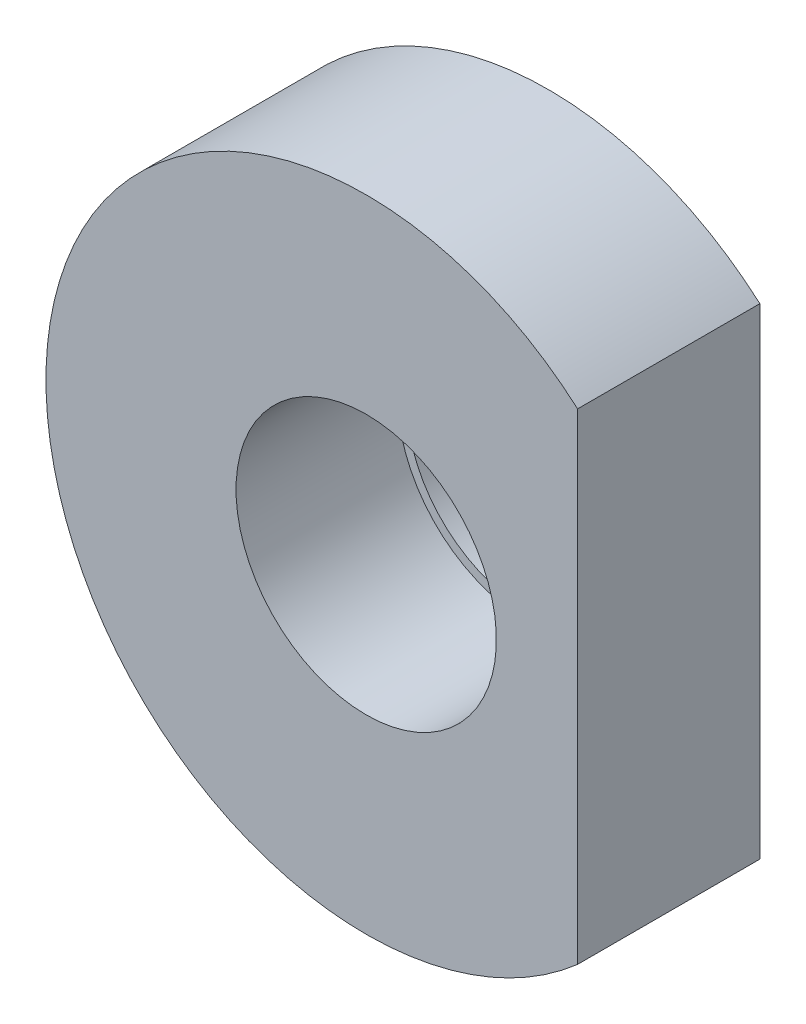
ISO-10303-21;
HEADER;
FILE_DESCRIPTION(('STEP AP214'),'2;1');
FILE_NAME('part.step','',(''),(''),'','','');
FILE_SCHEMA(('AUTOMOTIVE_DESIGN { 1 0 10303 214 1 1 1 1 }'));
ENDSEC;
DATA;
#1=APPLICATION_CONTEXT('core data for automotive mechanical design processes');
#2=APPLICATION_PROTOCOL_DEFINITION('international standard','automotive_design',2000,#1);
#3=PRODUCT_CONTEXT('',#1,'mechanical');
#4=PRODUCT('Part','Part','',(#3));
#5=PRODUCT_RELATED_PRODUCT_CATEGORY('part','',(#4));
#6=PRODUCT_DEFINITION_FORMATION('','',#4);
#7=PRODUCT_DEFINITION_CONTEXT('part definition',#1,'design');
#8=PRODUCT_DEFINITION('design','',#6,#7);
#9=PRODUCT_DEFINITION_SHAPE('','',#8);
#10=(LENGTH_UNIT() NAMED_UNIT(*) SI_UNIT(.MILLI.,.METRE.));
#11=(NAMED_UNIT(*) PLANE_ANGLE_UNIT() SI_UNIT($,.RADIAN.));
#12=(NAMED_UNIT(*) SI_UNIT($,.STERADIAN.) SOLID_ANGLE_UNIT());
#13=UNCERTAINTY_MEASURE_WITH_UNIT(LENGTH_MEASURE(1.E-05),#10,'distance_accuracy_value','');
#14=(GEOMETRIC_REPRESENTATION_CONTEXT(3) GLOBAL_UNCERTAINTY_ASSIGNED_CONTEXT((#13)) GLOBAL_UNIT_ASSIGNED_CONTEXT((#10,
#11,#12)) REPRESENTATION_CONTEXT('',''));
#15=CARTESIAN_POINT('',(0.,0.,0.));
#16=DIRECTION('',(0.,0.,1.));
#17=DIRECTION('',(1.,0.,0.));
#18=AXIS2_PLACEMENT_3D('',#15,#16,#17);
#19=CARTESIAN_POINT('',(0.,0.,8.89));
#20=DIRECTION('',(0.,0.,-1.));
#21=DIRECTION('',(0.,1.,0.));
#22=AXIS2_PLACEMENT_3D('',#19,#20,#21);
#23=CYLINDRICAL_SURFACE('',#22,15.621);
#24=DIRECTION('',(0.,0.,-1.));
#25=VECTOR('',#24,1.);
#26=CARTESIAN_POINT('',(10.3124,-11.7332879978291,67.4479521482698));
#27=LINE('',#26,#25);
#28=CARTESIAN_POINT('',(10.3124,-11.7332879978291,8.89));
#29=VERTEX_POINT('',#28);
#30=CARTESIAN_POINT('',(10.3124,-11.7332879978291,0.));
#31=VERTEX_POINT('',#30);
#32=EDGE_CURVE('E35',#29,#31,#27,.T.);
#33=ORIENTED_EDGE('',*,*,#32,.F.);
#34=CARTESIAN_POINT('',(0.,0.,8.89));
#35=DIRECTION('',(0.,0.,1.));
#36=DIRECTION('',(0.,-1.,0.));
#37=AXIS2_PLACEMENT_3D('',#34,#35,#36);
#38=CIRCLE('',#37,15.621);
#39=CARTESIAN_POINT('',(10.3124,11.7332879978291,8.89));
#40=VERTEX_POINT('',#39);
#41=EDGE_CURVE('E22',#40,#29,#38,.T.);
#42=ORIENTED_EDGE('',*,*,#41,.F.);
#43=DIRECTION('',(0.,0.,-1.));
#44=VECTOR('',#43,1.);
#45=CARTESIAN_POINT('',(10.3124,11.7332879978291,67.4479521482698));
#46=LINE('',#45,#44);
#47=CARTESIAN_POINT('',(10.3124,11.7332879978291,0.));
#48=VERTEX_POINT('',#47);
#49=EDGE_CURVE('E48',#40,#48,#46,.T.);
#50=ORIENTED_EDGE('',*,*,#49,.T.);
#51=CARTESIAN_POINT('',(0.,0.,0.));
#52=DIRECTION('',(0.,0.,1.));
#53=DIRECTION('',(0.,-1.,0.));
#54=AXIS2_PLACEMENT_3D('',#51,#52,#53);
#55=CIRCLE('',#54,15.621);
#56=EDGE_CURVE('E42',#48,#31,#55,.T.);
#57=ORIENTED_EDGE('',*,*,#56,.T.);
#58=EDGE_LOOP('',(#33,#42,#50,#57));
#59=FACE_BOUND('',#58,.T.);
#60=ADVANCED_FACE('F14',(#59),#23,.T.);
#61=CARTESIAN_POINT('',(0.,0.,8.89));
#62=DIRECTION('',(0.,0.,1.));
#63=DIRECTION('',(0.,-1.,0.));
#64=AXIS2_PLACEMENT_3D('',#61,#62,#63);
#65=PLANE('',#64);
#66=CARTESIAN_POINT('',(0.,0.,8.89));
#67=DIRECTION('',(0.,0.,1.));
#68=DIRECTION('',(0.,-1.,0.));
#69=AXIS2_PLACEMENT_3D('',#66,#67,#68);
#70=CIRCLE('',#69,6.35);
#71=CARTESIAN_POINT('',(0.,-6.35,8.89));
#72=VERTEX_POINT('',#71);
#73=EDGE_CURVE('E17',#72,#72,#70,.T.);
#74=ORIENTED_EDGE('',*,*,#73,.F.);
#75=EDGE_LOOP('',(#74));
#76=FACE_BOUND('',#75,.T.);
#77=ORIENTED_EDGE('',*,*,#41,.T.);
#78=DIRECTION('',(0.,1.,0.));
#79=VECTOR('',#78,1.);
#80=CARTESIAN_POINT('',(10.3124,0.,8.89));
#81=LINE('',#80,#79);
#82=EDGE_CURVE('E28',#29,#40,#81,.T.);
#83=ORIENTED_EDGE('',*,*,#82,.T.);
#84=EDGE_LOOP('',(#77,#83));
#85=FACE_BOUND('',#84,.T.);
#86=ADVANCED_FACE('F58',(#76,#85),#65,.T.);
#87=CARTESIAN_POINT('',(0.,0.,0.));
#88=DIRECTION('',(0.,0.,1.));
#89=DIRECTION('',(0.,-1.,0.));
#90=AXIS2_PLACEMENT_3D('',#87,#88,#89);
#91=PLANE('',#90);
#92=DIRECTION('',(0.,1.,0.));
#93=VECTOR('',#92,1.);
#94=CARTESIAN_POINT('',(10.3124,0.,0.));
#95=LINE('',#94,#93);
#96=EDGE_CURVE('E9',#31,#48,#95,.T.);
#97=ORIENTED_EDGE('',*,*,#96,.F.);
#98=ORIENTED_EDGE('',*,*,#56,.F.);
#99=EDGE_LOOP('',(#97,#98));
#100=FACE_BOUND('',#99,.T.);
#101=CARTESIAN_POINT('',(0.,0.,0.));
#102=DIRECTION('',(0.,0.,1.));
#103=DIRECTION('',(1.,0.,0.));
#104=AXIS2_PLACEMENT_3D('',#101,#102,#103);
#105=CIRCLE('',#104,5.9);
#106=CARTESIAN_POINT('',(5.9,0.,0.));
#107=VERTEX_POINT('',#106);
#108=EDGE_CURVE('E89',#107,#107,#105,.F.);
#109=ORIENTED_EDGE('',*,*,#108,.F.);
#110=EDGE_LOOP('',(#109));
#111=FACE_BOUND('',#110,.T.);
#112=ADVANCED_FACE('F44',(#100,#111),#91,.F.);
#113=CARTESIAN_POINT('',(10.3124,11.7332879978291,67.4479521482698));
#114=DIRECTION('',(1.,0.,0.));
#115=DIRECTION('',(0.,0.,1.));
#116=AXIS2_PLACEMENT_3D('',#113,#114,#115);
#117=PLANE('',#116);
#118=ORIENTED_EDGE('',*,*,#82,.F.);
#119=ORIENTED_EDGE('',*,*,#32,.T.);
#120=ORIENTED_EDGE('',*,*,#96,.T.);
#121=ORIENTED_EDGE('',*,*,#49,.F.);
#122=EDGE_LOOP('',(#118,#119,#120,#121));
#123=FACE_BOUND('',#122,.T.);
#124=ADVANCED_FACE('F51',(#123),#117,.T.);
#125=CARTESIAN_POINT('',(0.,0.,13.2527327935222));
#126=DIRECTION('',(0.,0.,1.));
#127=DIRECTION('',(0.,-1.,0.));
#128=AXIS2_PLACEMENT_3D('',#125,#126,#127);
#129=CYLINDRICAL_SURFACE('',#128,6.35);
#130=ORIENTED_EDGE('',*,*,#73,.T.);
#131=EDGE_LOOP('',(#130));
#132=FACE_BOUND('',#131,.T.);
#133=CARTESIAN_POINT('',(0.,0.,1.016));
#134=DIRECTION('',(0.,0.,1.));
#135=DIRECTION('',(0.,-1.,0.));
#136=AXIS2_PLACEMENT_3D('',#133,#134,#135);
#137=CIRCLE('',#136,6.35);
#138=CARTESIAN_POINT('',(0.,-6.35,1.016));
#139=VERTEX_POINT('',#138);
#140=EDGE_CURVE('E55',#139,#139,#137,.T.);
#141=ORIENTED_EDGE('',*,*,#140,.F.);
#142=EDGE_LOOP('',(#141));
#143=FACE_BOUND('',#142,.T.);
#144=ADVANCED_FACE('F72',(#132,#143),#129,.F.);
#145=CARTESIAN_POINT('',(0.,-6.35,1.016));
#146=DIRECTION('',(0.,0.,-1.));
#147=DIRECTION('',(0.,1.,0.));
#148=AXIS2_PLACEMENT_3D('',#145,#146,#147);
#149=PLANE('',#148);
#150=ORIENTED_EDGE('',*,*,#140,.T.);
#151=EDGE_LOOP('',(#150));
#152=FACE_BOUND('',#151,.T.);
#153=CARTESIAN_POINT('',(0.,0.,1.016));
#154=DIRECTION('',(0.,0.,1.));
#155=DIRECTION('',(1.,0.,0.));
#156=AXIS2_PLACEMENT_3D('',#153,#154,#155);
#157=CIRCLE('',#156,5.9);
#158=CARTESIAN_POINT('',(5.9,0.,1.016));
#159=VERTEX_POINT('',#158);
#160=EDGE_CURVE('E92',#159,#159,#157,.T.);
#161=ORIENTED_EDGE('',*,*,#160,.F.);
#162=EDGE_LOOP('',(#161));
#163=FACE_BOUND('',#162,.T.);
#164=ADVANCED_FACE('F75',(#152,#163),#149,.F.);
#165=CARTESIAN_POINT('',(0.,0.,-17.9605122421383));
#166=DIRECTION('',(0.,0.,1.));
#167=DIRECTION('',(1.,0.,0.));
#168=AXIS2_PLACEMENT_3D('',#165,#166,#167);
#169=CYLINDRICAL_SURFACE('',#168,5.9);
#170=ORIENTED_EDGE('',*,*,#108,.T.);
#171=EDGE_LOOP('',(#170));
#172=FACE_BOUND('',#171,.T.);
#173=ORIENTED_EDGE('',*,*,#160,.T.);
#174=EDGE_LOOP('',(#173));
#175=FACE_BOUND('',#174,.T.);
#176=ADVANCED_FACE('F79',(#172,#175),#169,.F.);
#177=CLOSED_SHELL('',(#60,#86,#112,#124,#144,#164,#176));
#178=MANIFOLD_SOLID_BREP('B1',#177);
#179=ADVANCED_BREP_SHAPE_REPRESENTATION('',(#18,#178),#14);
#180=SHAPE_DEFINITION_REPRESENTATION(#9,#179);
ENDSEC;
END-ISO-10303-21;
